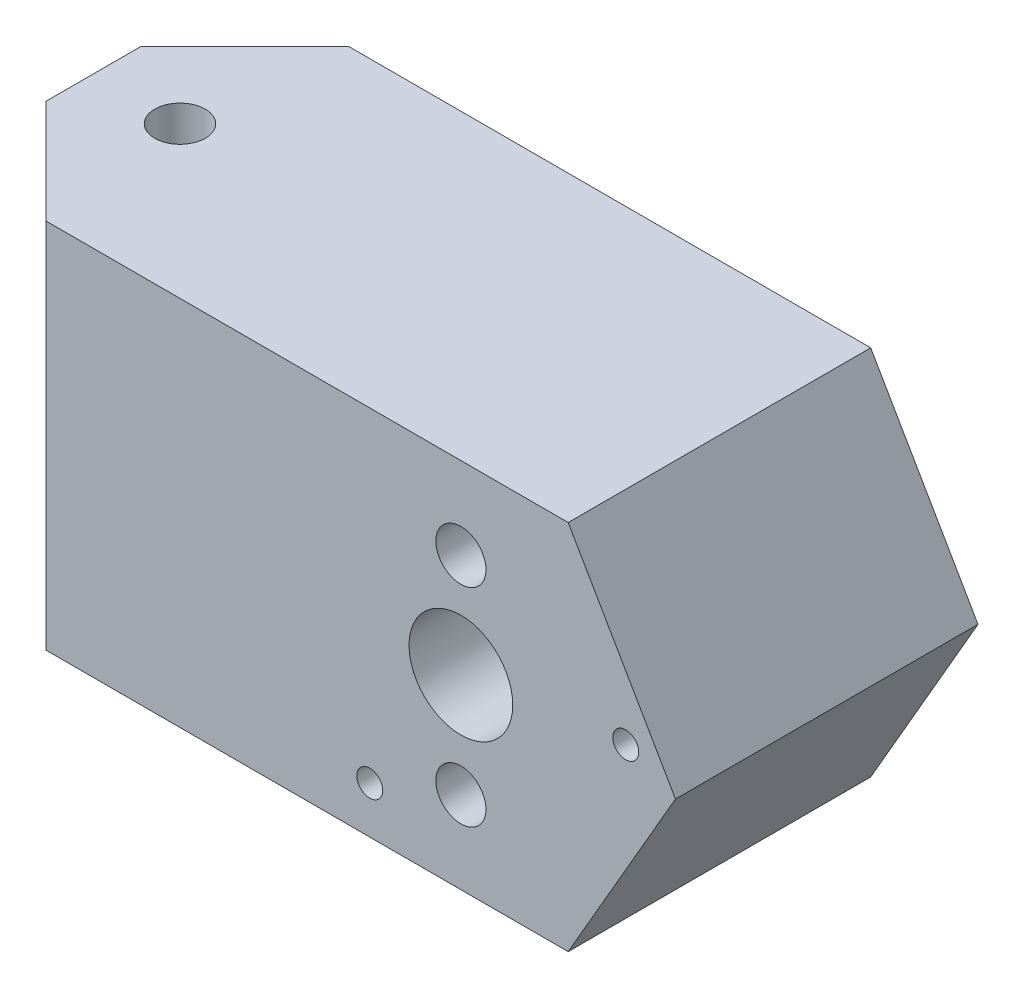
from build123d import *

# Parameters (mm, degrees)
ESQUISSE1_R                  = 2.9
ESQUISSE1_R_2                = 8
BOSS_EXTRU_1_DEPTH           = 17.5
ESQUISSE3_R                  = 8.5
ESQUISSE3_R_2                = 6
BOSS_EXTRU_2_DEPTH           = 10
ESQUISSE4_R                  = 1.5
ENL_V_MAT_EXTRU_2_DEPTH      = 73.713478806
ENL_V_MAT_EXTRU_3_DEPTH      = 76.863364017
ENL_V_MAT_EXTRU_3_DEPTH_BACK = 76.863364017
ESQUISSE5_R                  = 2.925
CHANFREIN1_SIZE              = 12


with BuildPart() as part:
    # Esquisse1 → Boss.-Extru.1 (new, symmetric)
    with BuildSketch(Plane.XY):
        Polygon((-12.413030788, -21.5), (12.413030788, -21.5), (24.826061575, 0), (12.413030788, 21.5), (-12.413030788, 21.5), (-60, 21.5), (-60, -21.5), align=None)
        with Locations((0, 12)):
            Circle(ESQUISSE1_R, mode=Mode.SUBTRACT)
        with Locations((0, -12)):
            Circle(ESQUISSE1_R, mode=Mode.SUBTRACT)
        Circle(ESQUISSE1_R_2, mode=Mode.SUBTRACT)
    extrude(amount=BOSS_EXTRU_1_DEPTH, both=True)

    # Esquisse3 → Boss.-Extru.2 (add)
    with BuildSketch(Plane.XY.offset(17.5)):
        Circle(ESQUISSE3_R)
        Circle(ESQUISSE3_R_2, mode=Mode.SUBTRACT)
    extrude(amount=-BOSS_EXTRU_2_DEPTH)

    # Esquisse4 → Enl_v. mat.-Extru.2 (cut, through all)
    with BuildSketch(Plane.XY.offset(17.5)):
        with Locations((-10.543796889, -16.095910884)):
            Circle(ESQUISSE4_R)
        with Locations(Location((19.071140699, 2.557653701, 0), (0, 0, 180))):
            Circle(ESQUISSE4_R)
    extrude(amount=-ENL_V_MAT_EXTRU_2_DEPTH, mode=Mode.SUBTRACT)

    # Esquisse5 → Enl_v. mat.-Extru.3 (cut, two sides: drawn at the far end of the back side and taken through both)
    with BuildSketch(Plane.XZ.offset(21.5).offset(-ENL_V_MAT_EXTRU_3_DEPTH_BACK)):
        with Locations(Location((-50, 0, 0), (0, 0, 270))):
            Circle(ESQUISSE5_R)
    extrude(amount=ENL_V_MAT_EXTRU_3_DEPTH + ENL_V_MAT_EXTRU_3_DEPTH_BACK, mode=Mode.SUBTRACT)

    # Chanfrein1
    chanfrein1_edges = [part.edges().sort_by_distance(p)[0] for p in [
        (-60, 0, 17.5),
        (-60, 0, -17.5),
    ]]
    chamfer(chanfrein1_edges, length=CHANFREIN1_SIZE)


solid = part.part
